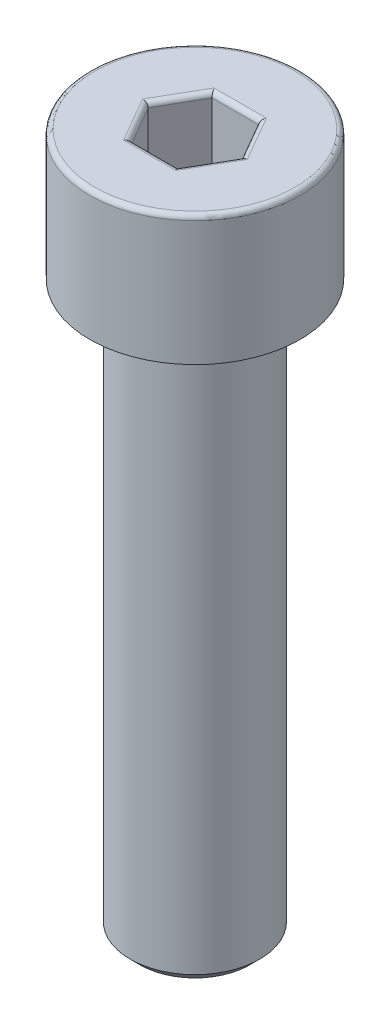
ISO-10303-21;
HEADER;
FILE_DESCRIPTION(('STEP AP214'),'2;1');
FILE_NAME('part.step','',(''),(''),'','','');
FILE_SCHEMA(('AUTOMOTIVE_DESIGN { 1 0 10303 214 1 1 1 1 }'));
ENDSEC;
DATA;
#1=APPLICATION_CONTEXT('core data for automotive mechanical design processes');
#2=APPLICATION_PROTOCOL_DEFINITION('international standard','automotive_design',2000,#1);
#3=PRODUCT_CONTEXT('',#1,'mechanical');
#4=PRODUCT('Part','Part','',(#3));
#5=PRODUCT_RELATED_PRODUCT_CATEGORY('part','',(#4));
#6=PRODUCT_DEFINITION_FORMATION('','',#4);
#7=PRODUCT_DEFINITION_CONTEXT('part definition',#1,'design');
#8=PRODUCT_DEFINITION('design','',#6,#7);
#9=PRODUCT_DEFINITION_SHAPE('','',#8);
#10=(LENGTH_UNIT() NAMED_UNIT(*) SI_UNIT(.MILLI.,.METRE.));
#11=(NAMED_UNIT(*) PLANE_ANGLE_UNIT() SI_UNIT($,.RADIAN.));
#12=(NAMED_UNIT(*) SI_UNIT($,.STERADIAN.) SOLID_ANGLE_UNIT());
#13=UNCERTAINTY_MEASURE_WITH_UNIT(LENGTH_MEASURE(1.E-05),#10,'distance_accuracy_value','');
#14=(GEOMETRIC_REPRESENTATION_CONTEXT(3) GLOBAL_UNCERTAINTY_ASSIGNED_CONTEXT((#13)) GLOBAL_UNIT_ASSIGNED_CONTEXT((#10,
#11,#12)) REPRESENTATION_CONTEXT('',''));
#15=CARTESIAN_POINT('',(0.,0.,0.));
#16=DIRECTION('',(0.,0.,1.));
#17=DIRECTION('',(1.,0.,0.));
#18=AXIS2_PLACEMENT_3D('',#15,#16,#17);
#19=CARTESIAN_POINT('',(1.52129228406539,26.4588839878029,0.));
#20=DIRECTION('',(0.,1.,0.));
#21=DIRECTION('',(0.,0.,1.));
#22=AXIS2_PLACEMENT_3D('',#19,#20,#21);
#23=PLANE('',#22);
#24=DIRECTION('',(0.5,0.,-0.866025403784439));
#25=VECTOR('',#24,1.);
#26=CARTESIAN_POINT('',(2.96466795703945,26.4588839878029,2.5));
#27=LINE('',#26,#25);
#28=CARTESIAN_POINT('',(2.96466795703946,26.4588839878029,2.5));
#29=VERTEX_POINT('',#28);
#30=CARTESIAN_POINT('',(4.40804363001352,26.4588839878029,0.));
#31=VERTEX_POINT('',#30);
#32=EDGE_CURVE('E141',#29,#31,#27,.T.);
#33=ORIENTED_EDGE('',*,*,#32,.T.);
#34=DIRECTION('',(-0.5,0.,-0.866025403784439));
#35=VECTOR('',#34,1.);
#36=CARTESIAN_POINT('',(4.40804363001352,26.4588839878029,0.));
#37=LINE('',#36,#35);
#38=CARTESIAN_POINT('',(2.96466795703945,26.4588839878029,-2.5));
#39=VERTEX_POINT('',#38);
#40=EDGE_CURVE('E147',#31,#39,#37,.T.);
#41=ORIENTED_EDGE('',*,*,#40,.T.);
#42=DIRECTION('',(-1.,0.,0.));
#43=VECTOR('',#42,1.);
#44=CARTESIAN_POINT('',(2.96466795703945,26.4588839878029,-2.5));
#45=LINE('',#44,#43);
#46=CARTESIAN_POINT('',(0.0779166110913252,26.4588839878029,-2.5));
#47=VERTEX_POINT('',#46);
#48=EDGE_CURVE('E158',#39,#47,#45,.T.);
#49=ORIENTED_EDGE('',*,*,#48,.T.);
#50=DIRECTION('',(-0.5,0.,0.866025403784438));
#51=VECTOR('',#50,1.);
#52=CARTESIAN_POINT('',(0.0779166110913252,26.4588839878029,-2.5));
#53=LINE('',#52,#51);
#54=CARTESIAN_POINT('',(-1.36545906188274,26.4588839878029,0.));
#55=VERTEX_POINT('',#54);
#56=EDGE_CURVE('E121',#47,#55,#53,.T.);
#57=ORIENTED_EDGE('',*,*,#56,.T.);
#58=DIRECTION('',(0.5,0.,0.866025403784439));
#59=VECTOR('',#58,1.);
#60=CARTESIAN_POINT('',(-1.36545906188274,26.4588839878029,0.));
#61=LINE('',#60,#59);
#62=CARTESIAN_POINT('',(0.0779166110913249,26.4588839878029,2.5));
#63=VERTEX_POINT('',#62);
#64=EDGE_CURVE('E131',#55,#63,#61,.T.);
#65=ORIENTED_EDGE('',*,*,#64,.T.);
#66=DIRECTION('',(1.,0.,0.));
#67=VECTOR('',#66,1.);
#68=CARTESIAN_POINT('',(0.077916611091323,26.4588839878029,2.5));
#69=LINE('',#68,#67);
#70=EDGE_CURVE('E136',#63,#29,#69,.T.);
#71=ORIENTED_EDGE('',*,*,#70,.T.);
#72=EDGE_LOOP('',(#33,#41,#49,#57,#65,#71));
#73=FACE_BOUND('',#72,.T.);
#74=ADVANCED_FACE('F17',(#73),#23,.T.);
#75=CARTESIAN_POINT('',(2.96466795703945,30.9588839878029,-2.5));
#76=DIRECTION('',(0.,0.,-1.));
#77=DIRECTION('',(-1.,0.,0.));
#78=AXIS2_PLACEMENT_3D('',#75,#76,#77);
#79=PLANE('',#78);
#80=DIRECTION('',(0.,1.,0.));
#81=VECTOR('',#80,1.);
#82=CARTESIAN_POINT('',(0.077916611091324,30.9588839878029,-2.5));
#83=LINE('',#82,#81);
#84=CARTESIAN_POINT('',(0.077916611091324,30.6588839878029,-2.5));
#85=VERTEX_POINT('',#84);
#86=EDGE_CURVE('E124',#85,#47,#83,.F.);
#87=ORIENTED_EDGE('',*,*,#86,.T.);
#88=ORIENTED_EDGE('',*,*,#48,.F.);
#89=DIRECTION('',(0.,1.,0.));
#90=VECTOR('',#89,1.);
#91=CARTESIAN_POINT('',(2.96466795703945,30.9588839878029,-2.5));
#92=LINE('',#91,#90);
#93=CARTESIAN_POINT('',(2.96466795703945,30.6588839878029,-2.5));
#94=VERTEX_POINT('',#93);
#95=EDGE_CURVE('E144',#39,#94,#92,.T.);
#96=ORIENTED_EDGE('',*,*,#95,.T.);
#97=DIRECTION('',(1.,0.,0.));
#98=VECTOR('',#97,1.);
#99=CARTESIAN_POINT('',(0.692980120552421,30.6588839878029,-2.5));
#100=LINE('',#99,#98);
#101=EDGE_CURVE('E77',#85,#94,#100,.T.);
#102=ORIENTED_EDGE('',*,*,#101,.F.);
#103=EDGE_LOOP('',(#87,#88,#96,#102));
#104=FACE_BOUND('',#103,.T.);
#105=ADVANCED_FACE('F373',(#104),#79,.F.);
#106=CARTESIAN_POINT('',(4.40804363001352,30.9588839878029,0.));
#107=DIRECTION('',(0.866025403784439,0.,-0.5));
#108=DIRECTION('',(-0.5,0.,-0.866025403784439));
#109=AXIS2_PLACEMENT_3D('',#106,#107,#108);
#110=PLANE('',#109);
#111=ORIENTED_EDGE('',*,*,#95,.F.);
#112=ORIENTED_EDGE('',*,*,#40,.F.);
#113=DIRECTION('',(0.,1.,0.));
#114=VECTOR('',#113,1.);
#115=CARTESIAN_POINT('',(4.40804363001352,30.9588839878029,0.));
#116=LINE('',#115,#114);
#117=CARTESIAN_POINT('',(4.40804363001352,30.6588839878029,0.));
#118=VERTEX_POINT('',#117);
#119=EDGE_CURVE('E139',#31,#118,#116,.T.);
#120=ORIENTED_EDGE('',*,*,#119,.T.);
#121=DIRECTION('',(0.5,0.,0.866025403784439));
#122=VECTOR('',#121,1.);
#123=CARTESIAN_POINT('',(3.65969971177,30.6588839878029,-1.29616968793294));
#124=LINE('',#123,#122);
#125=EDGE_CURVE('E81',#94,#118,#124,.T.);
#126=ORIENTED_EDGE('',*,*,#125,.F.);
#127=EDGE_LOOP('',(#111,#112,#120,#126));
#128=FACE_BOUND('',#127,.T.);
#129=ADVANCED_FACE('F365',(#128),#110,.F.);
#130=CARTESIAN_POINT('',(2.96466795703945,30.9588839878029,2.5));
#131=DIRECTION('',(0.866025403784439,0.,0.5));
#132=DIRECTION('',(0.5,0.,-0.866025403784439));
#133=AXIS2_PLACEMENT_3D('',#130,#131,#132);
#134=PLANE('',#133);
#135=ORIENTED_EDGE('',*,*,#119,.F.);
#136=ORIENTED_EDGE('',*,*,#32,.F.);
#137=DIRECTION('',(0.,1.,0.));
#138=VECTOR('',#137,1.);
#139=CARTESIAN_POINT('',(2.96466795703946,30.9588839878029,2.5));
#140=LINE('',#139,#138);
#141=CARTESIAN_POINT('',(2.96466795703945,30.6588839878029,2.5));
#142=VERTEX_POINT('',#141);
#143=EDGE_CURVE('E134',#29,#142,#140,.T.);
#144=ORIENTED_EDGE('',*,*,#143,.T.);
#145=DIRECTION('',(-0.5,0.,0.866025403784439));
#146=VECTOR('',#145,1.);
#147=CARTESIAN_POINT('',(2.93801187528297,30.6588839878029,2.54616968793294));
#148=LINE('',#147,#146);
#149=EDGE_CURVE('E80',#118,#142,#148,.T.);
#150=ORIENTED_EDGE('',*,*,#149,.F.);
#151=EDGE_LOOP('',(#135,#136,#144,#150));
#152=FACE_BOUND('',#151,.T.);
#153=ADVANCED_FACE('F357',(#152),#134,.F.);
#154=CARTESIAN_POINT('',(0.077916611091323,30.9588839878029,2.5));
#155=DIRECTION('',(0.,0.,1.));
#156=DIRECTION('',(1.,0.,0.));
#157=AXIS2_PLACEMENT_3D('',#154,#155,#156);
#158=PLANE('',#157);
#159=ORIENTED_EDGE('',*,*,#143,.F.);
#160=ORIENTED_EDGE('',*,*,#70,.F.);
#161=DIRECTION('',(0.,1.,0.));
#162=VECTOR('',#161,1.);
#163=CARTESIAN_POINT('',(0.0779166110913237,30.9588839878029,2.5));
#164=LINE('',#163,#162);
#165=CARTESIAN_POINT('',(0.0779166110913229,30.6588839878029,2.5));
#166=VERTEX_POINT('',#165);
#167=EDGE_CURVE('E127',#63,#166,#164,.T.);
#168=ORIENTED_EDGE('',*,*,#167,.T.);
#169=DIRECTION('',(-1.,0.,0.));
#170=VECTOR('',#169,1.);
#171=CARTESIAN_POINT('',(-0.750395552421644,30.6588839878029,2.5));
#172=LINE('',#171,#170);
#173=EDGE_CURVE('E111',#142,#166,#172,.T.);
#174=ORIENTED_EDGE('',*,*,#173,.F.);
#175=EDGE_LOOP('',(#159,#160,#168,#174));
#176=FACE_BOUND('',#175,.T.);
#177=ADVANCED_FACE('F349',(#176),#158,.F.);
#178=CARTESIAN_POINT('',(-1.36545906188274,30.9588839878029,0.));
#179=DIRECTION('',(-0.866025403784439,0.,0.5));
#180=DIRECTION('',(0.5,0.,0.866025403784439));
#181=AXIS2_PLACEMENT_3D('',#178,#179,#180);
#182=PLANE('',#181);
#183=ORIENTED_EDGE('',*,*,#167,.F.);
#184=ORIENTED_EDGE('',*,*,#64,.F.);
#185=DIRECTION('',(0.,1.,0.));
#186=VECTOR('',#185,1.);
#187=CARTESIAN_POINT('',(-1.36545906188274,30.9588839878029,0.));
#188=LINE('',#187,#186);
#189=CARTESIAN_POINT('',(-1.36545906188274,30.6588839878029,0.));
#190=VERTEX_POINT('',#189);
#191=EDGE_CURVE('E119',#55,#190,#188,.T.);
#192=ORIENTED_EDGE('',*,*,#191,.T.);
#193=DIRECTION('',(-0.5,0.,-0.866025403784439));
#194=VECTOR('',#193,1.);
#195=CARTESIAN_POINT('',(-1.39211514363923,30.6588839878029,-0.04616968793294));
#196=LINE('',#195,#194);
#197=EDGE_CURVE('E103',#166,#190,#196,.T.);
#198=ORIENTED_EDGE('',*,*,#197,.F.);
#199=EDGE_LOOP('',(#183,#184,#192,#198));
#200=FACE_BOUND('',#199,.T.);
#201=ADVANCED_FACE('F341',(#200),#182,.F.);
#202=CARTESIAN_POINT('',(0.077916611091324,30.9588839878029,-2.5));
#203=DIRECTION('',(-0.866025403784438,0.,-0.5));
#204=DIRECTION('',(-0.5,0.,0.866025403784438));
#205=AXIS2_PLACEMENT_3D('',#202,#203,#204);
#206=PLANE('',#205);
#207=ORIENTED_EDGE('',*,*,#191,.F.);
#208=ORIENTED_EDGE('',*,*,#56,.F.);
#209=ORIENTED_EDGE('',*,*,#86,.F.);
#210=DIRECTION('',(0.5,0.,-0.866025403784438));
#211=VECTOR('',#210,1.);
#212=CARTESIAN_POINT('',(-0.670427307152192,30.6588839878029,-1.20383031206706));
#213=LINE('',#212,#211);
#214=EDGE_CURVE('E185',#190,#85,#213,.T.);
#215=ORIENTED_EDGE('',*,*,#214,.F.);
#216=EDGE_LOOP('',(#207,#208,#209,#215));
#217=FACE_BOUND('',#216,.T.);
#218=ADVANCED_FACE('F334',(#217),#206,.F.);
#219=CARTESIAN_POINT('',(0.692980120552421,30.6588839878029,-2.8));
#220=DIRECTION('',(1.,0.,0.));
#221=DIRECTION('',(0.,1.,0.));
#222=AXIS2_PLACEMENT_3D('',#219,#220,#221);
#223=CYLINDRICAL_SURFACE('',#222,0.3);
#224=DIRECTION('',(1.,0.,0.));
#225=VECTOR('',#224,1.);
#226=CARTESIAN_POINT('',(-1.57870771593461,30.9588839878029,-2.8));
#227=LINE('',#226,#225);
#228=CARTESIAN_POINT('',(-0.0952884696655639,30.9588839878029,-2.8));
#229=VERTEX_POINT('',#228);
#230=CARTESIAN_POINT('',(3.13787303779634,30.9588839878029,-2.8));
#231=VERTEX_POINT('',#230);
#232=EDGE_CURVE('E75',#229,#231,#227,.T.);
#233=ORIENTED_EDGE('',*,*,#232,.F.);
#234=CARTESIAN_POINT('',(-0.0952884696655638,30.6588839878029,-2.8));
#235=DIRECTION('',(0.866025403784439,0.,-0.5));
#236=DIRECTION('',(0.5,0.,0.866025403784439));
#237=AXIS2_PLACEMENT_3D('',#234,#235,#236);
#238=ELLIPSE('',#237,0.346410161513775,0.3);
#239=EDGE_CURVE('E98',#85,#229,#238,.F.);
#240=ORIENTED_EDGE('',*,*,#239,.F.);
#241=ORIENTED_EDGE('',*,*,#101,.T.);
#242=CARTESIAN_POINT('',(3.13787303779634,30.6588839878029,-2.8));
#243=DIRECTION('',(0.866025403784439,0.,0.5));
#244=DIRECTION('',(0.5,0.,-0.866025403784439));
#245=AXIS2_PLACEMENT_3D('',#242,#243,#244);
#246=ELLIPSE('',#245,0.346410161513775,0.3);
#247=EDGE_CURVE('E20',#231,#94,#246,.T.);
#248=ORIENTED_EDGE('',*,*,#247,.F.);
#249=EDGE_LOOP('',(#233,#240,#241,#248));
#250=FACE_BOUND('',#249,.T.);
#251=ADVANCED_FACE('F72',(#250),#223,.T.);
#252=CARTESIAN_POINT('',(3.91950733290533,30.6588839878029,-1.44616968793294));
#253=DIRECTION('',(0.5,0.,0.866025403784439));
#254=DIRECTION('',(0.866025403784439,0.,-0.5));
#255=AXIS2_PLACEMENT_3D('',#252,#253,#254);
#256=CYLINDRICAL_SURFACE('',#255,0.3);
#257=DIRECTION('',(0.5,0.,0.866025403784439));
#258=VECTOR('',#257,1.);
#259=CARTESIAN_POINT('',(3.13787303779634,30.9588839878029,-2.8));
#260=LINE('',#259,#258);
#261=CARTESIAN_POINT('',(4.75445379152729,30.9588839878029,0.));
#262=VERTEX_POINT('',#261);
#263=EDGE_CURVE('E83',#231,#262,#260,.T.);
#264=ORIENTED_EDGE('',*,*,#263,.F.);
#265=ORIENTED_EDGE('',*,*,#247,.T.);
#266=ORIENTED_EDGE('',*,*,#125,.T.);
#267=CARTESIAN_POINT('',(4.75445379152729,30.6588839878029,0.));
#268=DIRECTION('',(0.,0.,1.));
#269=DIRECTION('',(1.,0.,0.));
#270=AXIS2_PLACEMENT_3D('',#267,#268,#269);
#271=ELLIPSE('',#270,0.346410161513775,0.3);
#272=EDGE_CURVE('E86',#262,#118,#271,.T.);
#273=ORIENTED_EDGE('',*,*,#272,.F.);
#274=EDGE_LOOP('',(#264,#265,#266,#273));
#275=FACE_BOUND('',#274,.T.);
#276=ADVANCED_FACE('F84',(#275),#256,.T.);
#277=CARTESIAN_POINT('',(3.1978194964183,30.6588839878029,2.69616968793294));
#278=DIRECTION('',(-0.5,0.,0.866025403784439));
#279=DIRECTION('',(0.866025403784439,0.,0.5));
#280=AXIS2_PLACEMENT_3D('',#277,#278,#279);
#281=CYLINDRICAL_SURFACE('',#280,0.3);
#282=DIRECTION('',(-0.5,0.,0.866025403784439));
#283=VECTOR('',#282,1.);
#284=CARTESIAN_POINT('',(4.75445379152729,30.9588839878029,0.));
#285=LINE('',#284,#283);
#286=CARTESIAN_POINT('',(3.13787303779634,30.9588839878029,2.8));
#287=VERTEX_POINT('',#286);
#288=EDGE_CURVE('E90',#262,#287,#285,.T.);
#289=ORIENTED_EDGE('',*,*,#288,.F.);
#290=ORIENTED_EDGE('',*,*,#272,.T.);
#291=ORIENTED_EDGE('',*,*,#149,.T.);
#292=CARTESIAN_POINT('',(3.13787303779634,30.6588839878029,2.8));
#293=DIRECTION('',(-0.866025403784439,0.,0.5));
#294=DIRECTION('',(-0.5,0.,-0.866025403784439));
#295=AXIS2_PLACEMENT_3D('',#292,#293,#294);
#296=ELLIPSE('',#295,0.346410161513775,0.3);
#297=EDGE_CURVE('E106',#287,#142,#296,.T.);
#298=ORIENTED_EDGE('',*,*,#297,.F.);
#299=EDGE_LOOP('',(#289,#290,#291,#298));
#300=FACE_BOUND('',#299,.T.);
#301=ADVANCED_FACE('F190',(#300),#281,.T.);
#302=CARTESIAN_POINT('',(-0.750395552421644,30.6588839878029,2.8));
#303=DIRECTION('',(-1.,0.,0.));
#304=DIRECTION('',(0.,-1.,0.));
#305=AXIS2_PLACEMENT_3D('',#302,#303,#304);
#306=CYLINDRICAL_SURFACE('',#305,0.3);
#307=DIRECTION('',(1.,0.,0.));
#308=VECTOR('',#307,1.);
#309=CARTESIAN_POINT('',(-1.57870771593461,30.9588839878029,2.8));
#310=LINE('',#309,#308);
#311=CARTESIAN_POINT('',(-0.0952884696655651,30.9588839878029,2.8));
#312=VERTEX_POINT('',#311);
#313=EDGE_CURVE('E107',#287,#312,#310,.F.);
#314=ORIENTED_EDGE('',*,*,#313,.F.);
#315=ORIENTED_EDGE('',*,*,#297,.T.);
#316=ORIENTED_EDGE('',*,*,#173,.T.);
#317=CARTESIAN_POINT('',(-0.0952884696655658,30.6588839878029,2.8));
#318=DIRECTION('',(-0.866025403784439,0.,-0.5));
#319=DIRECTION('',(0.5,0.,-0.866025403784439));
#320=AXIS2_PLACEMENT_3D('',#317,#318,#319);
#321=ELLIPSE('',#320,0.346410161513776,0.3);
#322=EDGE_CURVE('E105',#312,#166,#321,.T.);
#323=ORIENTED_EDGE('',*,*,#322,.F.);
#324=EDGE_LOOP('',(#314,#315,#316,#323));
#325=FACE_BOUND('',#324,.T.);
#326=ADVANCED_FACE('F194',(#325),#306,.T.);
#327=CARTESIAN_POINT('',(-1.65192276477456,30.6588839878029,0.10383031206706));
#328=DIRECTION('',(-0.5,0.,-0.866025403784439));
#329=DIRECTION('',(-0.866025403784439,0.,0.5));
#330=AXIS2_PLACEMENT_3D('',#327,#328,#329);
#331=CYLINDRICAL_SURFACE('',#330,0.3);
#332=DIRECTION('',(-0.5,0.,-0.866025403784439));
#333=VECTOR('',#332,1.);
#334=CARTESIAN_POINT('',(-0.095288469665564,30.9588839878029,2.8));
#335=LINE('',#334,#333);
#336=CARTESIAN_POINT('',(-1.71186922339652,30.9588839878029,0.));
#337=VERTEX_POINT('',#336);
#338=EDGE_CURVE('E110',#312,#337,#335,.T.);
#339=ORIENTED_EDGE('',*,*,#338,.F.);
#340=ORIENTED_EDGE('',*,*,#322,.T.);
#341=ORIENTED_EDGE('',*,*,#197,.T.);
#342=CARTESIAN_POINT('',(-1.71186922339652,30.6588839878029,0.));
#343=DIRECTION('',(0.,0.,-1.));
#344=DIRECTION('',(-1.,0.,0.));
#345=AXIS2_PLACEMENT_3D('',#342,#343,#344);
#346=ELLIPSE('',#345,0.346410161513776,0.3);
#347=EDGE_CURVE('E35',#337,#190,#346,.T.);
#348=ORIENTED_EDGE('',*,*,#347,.F.);
#349=EDGE_LOOP('',(#339,#340,#341,#348));
#350=FACE_BOUND('',#349,.T.);
#351=ADVANCED_FACE('F196',(#350),#331,.T.);
#352=CARTESIAN_POINT('',(-0.930234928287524,30.6588839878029,-1.35383031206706));
#353=DIRECTION('',(0.5,0.,-0.866025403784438));
#354=DIRECTION('',(-0.866025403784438,0.,-0.5));
#355=AXIS2_PLACEMENT_3D('',#352,#353,#354);
#356=CYLINDRICAL_SURFACE('',#355,0.3);
#357=DIRECTION('',(0.5,0.,-0.866025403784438));
#358=VECTOR('',#357,1.);
#359=CARTESIAN_POINT('',(-1.71186922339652,30.9588839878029,0.));
#360=LINE('',#359,#358);
#361=EDGE_CURVE('E96',#337,#229,#360,.T.);
#362=ORIENTED_EDGE('',*,*,#361,.F.);
#363=ORIENTED_EDGE('',*,*,#347,.T.);
#364=ORIENTED_EDGE('',*,*,#214,.T.);
#365=ORIENTED_EDGE('',*,*,#239,.T.);
#366=EDGE_LOOP('',(#362,#363,#364,#365));
#367=FACE_BOUND('',#366,.T.);
#368=ADVANCED_FACE('F298',(#367),#356,.T.);
#369=CARTESIAN_POINT('',(-1.57870771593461,30.9588839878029,0.));
#370=DIRECTION('',(0.,1.,0.));
#371=DIRECTION('',(0.,0.,1.));
#372=AXIS2_PLACEMENT_3D('',#369,#370,#371);
#373=PLANE('',#372);
#374=ORIENTED_EDGE('',*,*,#338,.T.);
#375=ORIENTED_EDGE('',*,*,#361,.T.);
#376=ORIENTED_EDGE('',*,*,#232,.T.);
#377=ORIENTED_EDGE('',*,*,#263,.T.);
#378=ORIENTED_EDGE('',*,*,#288,.T.);
#379=ORIENTED_EDGE('',*,*,#313,.T.);
#380=EDGE_LOOP('',(#374,#375,#376,#377,#378,#379));
#381=FACE_BOUND('',#380,.T.);
#382=CARTESIAN_POINT('',(1.52129228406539,30.9588839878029,0.));
#383=DIRECTION('',(0.,-1.,0.));
#384=DIRECTION('',(-1.,0.,0.));
#385=AXIS2_PLACEMENT_3D('',#382,#383,#384);
#386=CIRCLE('',#385,6.2);
#387=CARTESIAN_POINT('',(-4.67870771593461,30.9588839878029,0.));
#388=VERTEX_POINT('',#387);
#389=EDGE_CURVE('E197',#388,#388,#386,.T.);
#390=ORIENTED_EDGE('',*,*,#389,.F.);
#391=EDGE_LOOP('',(#390));
#392=FACE_BOUND('',#391,.T.);
#393=ADVANCED_FACE('F94',(#381,#392),#373,.T.);
#394=CARTESIAN_POINT('',(1.52129228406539,30.6588839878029,0.));
#395=DIRECTION('',(0.,1.,0.));
#396=DIRECTION('',(0.,0.,1.));
#397=AXIS2_PLACEMENT_3D('',#394,#395,#396);
#398=TOROIDAL_SURFACE('',#397,6.2,0.300000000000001);
#399=CARTESIAN_POINT('',(1.52129228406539,30.6588839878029,0.));
#400=DIRECTION('',(0.,1.,0.));
#401=DIRECTION('',(-1.,0.,0.));
#402=AXIS2_PLACEMENT_3D('',#399,#400,#401);
#403=CIRCLE('',#402,6.5);
#404=CARTESIAN_POINT('',(-4.97870771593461,30.6588839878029,0.));
#405=VERTEX_POINT('',#404);
#406=EDGE_CURVE('E182',#405,#405,#403,.F.);
#407=ORIENTED_EDGE('',*,*,#406,.F.);
#408=EDGE_LOOP('',(#407));
#409=FACE_BOUND('',#408,.T.);
#410=ORIENTED_EDGE('',*,*,#389,.T.);
#411=EDGE_LOOP('',(#410));
#412=FACE_BOUND('',#411,.T.);
#413=ADVANCED_FACE('F207',(#409,#412),#398,.T.);
#414=CARTESIAN_POINT('',(1.52129228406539,26.8088839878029,0.));
#415=DIRECTION('',(0.,1.,0.));
#416=DIRECTION('',(-1.,0.,0.));
#417=AXIS2_PLACEMENT_3D('',#414,#415,#416);
#418=CYLINDRICAL_SURFACE('',#417,6.5);
#419=CARTESIAN_POINT('',(1.52129228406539,22.9588839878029,0.));
#420=DIRECTION('',(0.,1.,0.));
#421=DIRECTION('',(-1.,0.,0.));
#422=AXIS2_PLACEMENT_3D('',#419,#420,#421);
#423=CIRCLE('',#422,6.5);
#424=CARTESIAN_POINT('',(-4.97870771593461,22.9588839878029,0.));
#425=VERTEX_POINT('',#424);
#426=EDGE_CURVE('E180',#425,#425,#423,.F.);
#427=ORIENTED_EDGE('',*,*,#426,.F.);
#428=EDGE_LOOP('',(#427));
#429=FACE_BOUND('',#428,.T.);
#430=ORIENTED_EDGE('',*,*,#406,.T.);
#431=EDGE_LOOP('',(#430));
#432=FACE_BOUND('',#431,.T.);
#433=ADVANCED_FACE('F218',(#429,#432),#418,.T.);
#434=CARTESIAN_POINT('',(-0.178707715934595,-12.0411160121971,0.));
#435=DIRECTION('',(0.,-1.,0.));
#436=DIRECTION('',(0.,0.,-1.));
#437=AXIS2_PLACEMENT_3D('',#434,#435,#436);
#438=PLANE('',#437);
#439=CARTESIAN_POINT('',(1.52129228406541,-12.0411160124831,0.));
#440=DIRECTION('',(0.,1.,0.));
#441=DIRECTION('',(-1.,0.,0.));
#442=AXIS2_PLACEMENT_3D('',#439,#440,#441);
#443=CIRCLE('',#442,3.40000000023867);
#444=CARTESIAN_POINT('',(-1.87870771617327,-12.0411160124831,0.));
#445=VERTEX_POINT('',#444);
#446=EDGE_CURVE('E177',#445,#445,#443,.T.);
#447=ORIENTED_EDGE('',*,*,#446,.F.);
#448=EDGE_LOOP('',(#447));
#449=FACE_BOUND('',#448,.T.);
#450=ADVANCED_FACE('F243',(#449),#438,.T.);
#451=CARTESIAN_POINT('',(-3.72870771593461,22.9588839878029,0.));
#452=DIRECTION('',(0.,-1.,0.));
#453=DIRECTION('',(0.,0.,-1.));
#454=AXIS2_PLACEMENT_3D('',#451,#452,#453);
#455=PLANE('',#454);
#456=CARTESIAN_POINT('',(1.52129228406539,22.9588839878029,0.));
#457=DIRECTION('',(0.,1.,0.));
#458=DIRECTION('',(-1.,0.,0.));
#459=AXIS2_PLACEMENT_3D('',#456,#457,#458);
#460=CIRCLE('',#459,4.);
#461=CARTESIAN_POINT('',(-2.47870771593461,22.9588839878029,0.));
#462=VERTEX_POINT('',#461);
#463=EDGE_CURVE('E26',#462,#462,#460,.F.);
#464=ORIENTED_EDGE('',*,*,#463,.F.);
#465=EDGE_LOOP('',(#464));
#466=FACE_BOUND('',#465,.T.);
#467=ORIENTED_EDGE('',*,*,#426,.T.);
#468=EDGE_LOOP('',(#467));
#469=FACE_BOUND('',#468,.T.);
#470=ADVANCED_FACE('F249',(#466,#469),#455,.T.);
#471=CARTESIAN_POINT('',(1.5212922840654,-11.4411160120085,0.));
#472=DIRECTION('',(0.,1.,0.));
#473=DIRECTION('',(-1.,0.,0.));
#474=AXIS2_PLACEMENT_3D('',#471,#472,#473);
#475=CONICAL_SURFACE('',#474,3.99999999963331,0.785398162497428);
#476=ORIENTED_EDGE('',*,*,#446,.T.);
#477=EDGE_LOOP('',(#476));
#478=FACE_BOUND('',#477,.T.);
#479=CARTESIAN_POINT('',(1.52129228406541,-11.4411160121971,0.));
#480=DIRECTION('',(0.,1.,0.));
#481=DIRECTION('',(-1.,0.,0.));
#482=AXIS2_PLACEMENT_3D('',#479,#480,#481);
#483=CIRCLE('',#482,4.);
#484=CARTESIAN_POINT('',(-2.47870771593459,-11.4411160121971,0.));
#485=VERTEX_POINT('',#484);
#486=EDGE_CURVE('E11',#485,#485,#483,.T.);
#487=ORIENTED_EDGE('',*,*,#486,.F.);
#488=EDGE_LOOP('',(#487));
#489=FACE_BOUND('',#488,.T.);
#490=ADVANCED_FACE('F254',(#478,#489),#475,.T.);
#491=CARTESIAN_POINT('',(1.5212922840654,5.75888398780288,0.));
#492=DIRECTION('',(0.,1.,0.));
#493=DIRECTION('',(-1.,0.,0.));
#494=AXIS2_PLACEMENT_3D('',#491,#492,#493);
#495=CYLINDRICAL_SURFACE('',#494,4.);
#496=ORIENTED_EDGE('',*,*,#486,.T.);
#497=EDGE_LOOP('',(#496));
#498=FACE_BOUND('',#497,.T.);
#499=ORIENTED_EDGE('',*,*,#463,.T.);
#500=EDGE_LOOP('',(#499));
#501=FACE_BOUND('',#500,.T.);
#502=ADVANCED_FACE('F252',(#498,#501),#495,.T.);
#503=CLOSED_SHELL('',(#74,#105,#129,#153,#177,#201,#218,#251,#276,#301,#326,#351,#368,#393,#413,
#433,#450,#470,#490,#502));
#504=MANIFOLD_SOLID_BREP('B1',#503);
#505=ADVANCED_BREP_SHAPE_REPRESENTATION('',(#18,#504),#14);
#506=SHAPE_DEFINITION_REPRESENTATION(#9,#505);
ENDSEC;
END-ISO-10303-21;
